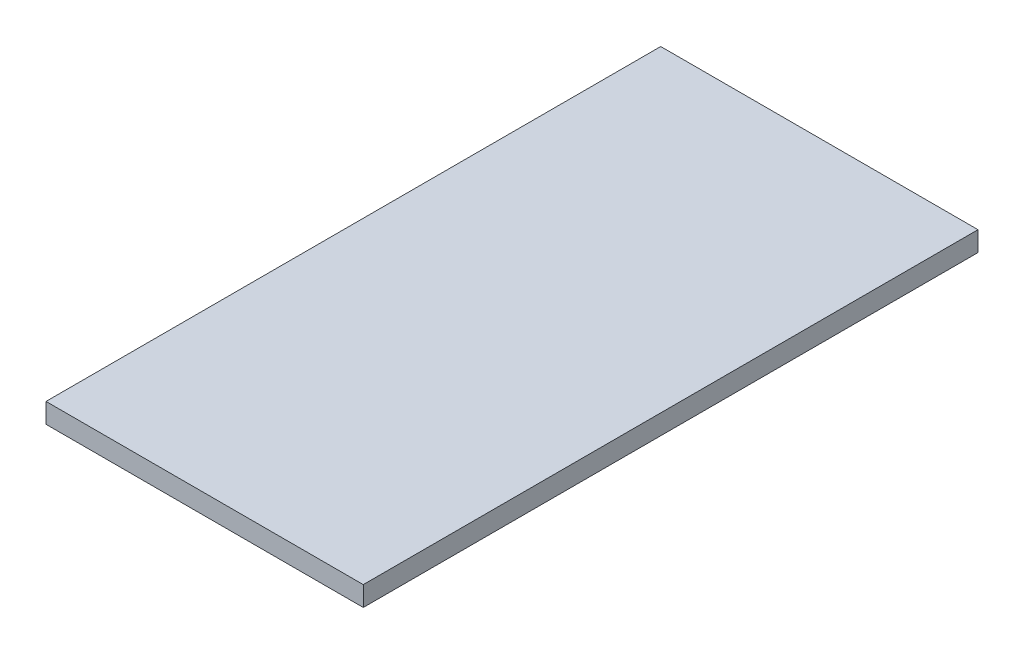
from build123d import *

# Parameters (mm, degrees)
ESQUISSE1_W        = 320
ESQUISSE1_H        = 620
BOSS_EXTRU_1_DEPTH = 20


with BuildPart() as part:
    # Esquisse1 → Boss.-Extru.1 (new body)
    with BuildSketch(Plane(origin=(0, 0, 0), x_dir=(1, 0, 0), z_dir=(0, 1, 0))):
        Rectangle(ESQUISSE1_W, ESQUISSE1_H)
    extrude(amount=BOSS_EXTRU_1_DEPTH)


solid = part.part
